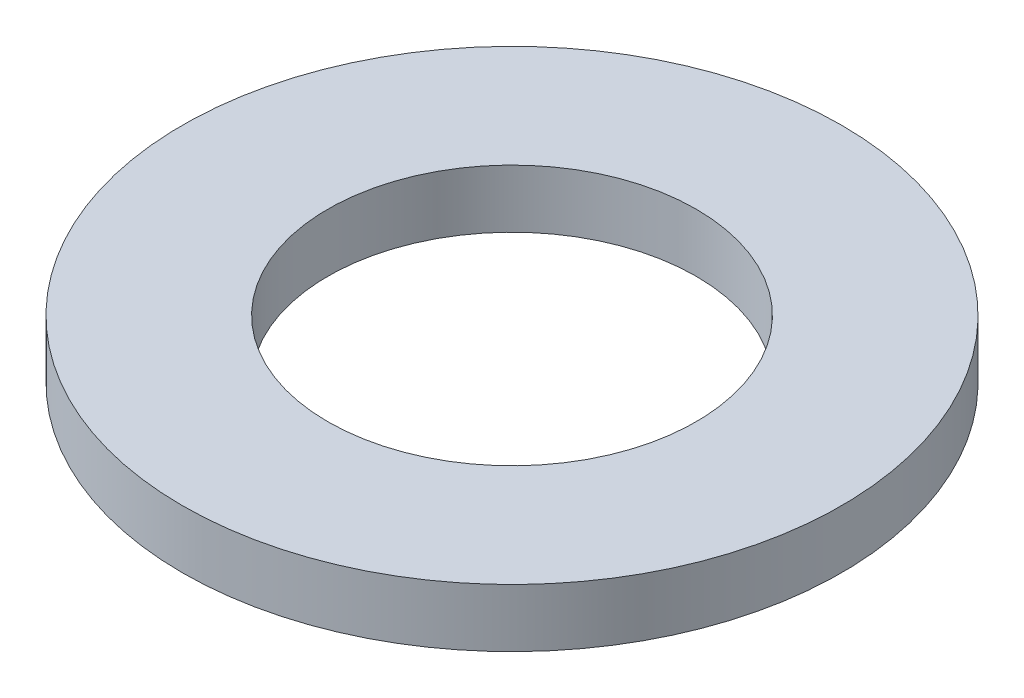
ISO-10303-21;
HEADER;
FILE_DESCRIPTION(('STEP AP214'),'2;1');
FILE_NAME('part.step','',(''),(''),'','','');
FILE_SCHEMA(('AUTOMOTIVE_DESIGN { 1 0 10303 214 1 1 1 1 }'));
ENDSEC;
DATA;
#1=APPLICATION_CONTEXT('core data for automotive mechanical design processes');
#2=APPLICATION_PROTOCOL_DEFINITION('international standard','automotive_design',2000,#1);
#3=PRODUCT_CONTEXT('',#1,'mechanical');
#4=PRODUCT('Part','Part','',(#3));
#5=PRODUCT_RELATED_PRODUCT_CATEGORY('part','',(#4));
#6=PRODUCT_DEFINITION_FORMATION('','',#4);
#7=PRODUCT_DEFINITION_CONTEXT('part definition',#1,'design');
#8=PRODUCT_DEFINITION('design','',#6,#7);
#9=PRODUCT_DEFINITION_SHAPE('','',#8);
#10=(LENGTH_UNIT() NAMED_UNIT(*) SI_UNIT(.MILLI.,.METRE.));
#11=(NAMED_UNIT(*) PLANE_ANGLE_UNIT() SI_UNIT($,.RADIAN.));
#12=(NAMED_UNIT(*) SI_UNIT($,.STERADIAN.) SOLID_ANGLE_UNIT());
#13=UNCERTAINTY_MEASURE_WITH_UNIT(LENGTH_MEASURE(1.E-05),#10,'distance_accuracy_value','');
#14=(GEOMETRIC_REPRESENTATION_CONTEXT(3) GLOBAL_UNCERTAINTY_ASSIGNED_CONTEXT((#13)) GLOBAL_UNIT_ASSIGNED_CONTEXT((#10,
#11,#12)) REPRESENTATION_CONTEXT('',''));
#15=CARTESIAN_POINT('',(0.,0.,0.));
#16=DIRECTION('',(0.,0.,1.));
#17=DIRECTION('',(1.,0.,0.));
#18=AXIS2_PLACEMENT_3D('',#15,#16,#17);
#19=CARTESIAN_POINT('',(0.,3.,0.));
#20=DIRECTION('',(0.,1.,0.));
#21=DIRECTION('',(0.,0.,1.));
#22=AXIS2_PLACEMENT_3D('',#19,#20,#21);
#23=PLANE('',#22);
#24=CARTESIAN_POINT('',(0.,3.,0.));
#25=DIRECTION('',(0.,1.,0.));
#26=DIRECTION('',(0.,0.,1.));
#27=AXIS2_PLACEMENT_3D('',#24,#25,#26);
#28=CIRCLE('',#27,17.);
#29=CARTESIAN_POINT('',(0.,3.,17.));
#30=VERTEX_POINT('',#29);
#31=EDGE_CURVE('E10',#30,#30,#28,.T.);
#32=ORIENTED_EDGE('',*,*,#31,.T.);
#33=EDGE_LOOP('',(#32));
#34=FACE_BOUND('',#33,.T.);
#35=CARTESIAN_POINT('',(0.,3.,0.));
#36=DIRECTION('',(0.,1.,0.));
#37=DIRECTION('',(0.,0.,1.));
#38=AXIS2_PLACEMENT_3D('',#35,#36,#37);
#39=CIRCLE('',#38,9.5);
#40=CARTESIAN_POINT('',(0.,3.,9.5));
#41=VERTEX_POINT('',#40);
#42=EDGE_CURVE('E39',#41,#41,#39,.T.);
#43=ORIENTED_EDGE('',*,*,#42,.F.);
#44=EDGE_LOOP('',(#43));
#45=FACE_BOUND('',#44,.T.);
#46=ADVANCED_FACE('F28',(#34,#45),#23,.T.);
#47=CARTESIAN_POINT('',(0.,0.,0.));
#48=DIRECTION('',(0.,1.,0.));
#49=DIRECTION('',(0.,0.,1.));
#50=AXIS2_PLACEMENT_3D('',#47,#48,#49);
#51=PLANE('',#50);
#52=CARTESIAN_POINT('',(0.,0.,0.));
#53=DIRECTION('',(0.,1.,0.));
#54=DIRECTION('',(0.,0.,1.));
#55=AXIS2_PLACEMENT_3D('',#52,#53,#54);
#56=CIRCLE('',#55,17.);
#57=CARTESIAN_POINT('',(0.,0.,17.));
#58=VERTEX_POINT('',#57);
#59=EDGE_CURVE('E35',#58,#58,#56,.T.);
#60=ORIENTED_EDGE('',*,*,#59,.F.);
#61=EDGE_LOOP('',(#60));
#62=FACE_BOUND('',#61,.T.);
#63=CARTESIAN_POINT('',(0.,0.,0.));
#64=DIRECTION('',(0.,1.,0.));
#65=DIRECTION('',(0.,0.,1.));
#66=AXIS2_PLACEMENT_3D('',#63,#64,#65);
#67=CIRCLE('',#66,9.5);
#68=CARTESIAN_POINT('',(0.,0.,9.5));
#69=VERTEX_POINT('',#68);
#70=EDGE_CURVE('E43',#69,#69,#67,.T.);
#71=ORIENTED_EDGE('',*,*,#70,.T.);
#72=EDGE_LOOP('',(#71));
#73=FACE_BOUND('',#72,.T.);
#74=ADVANCED_FACE('F49',(#62,#73),#51,.F.);
#75=CARTESIAN_POINT('',(0.,3.,0.));
#76=DIRECTION('',(0.,-1.,0.));
#77=DIRECTION('',(0.,0.,-1.));
#78=AXIS2_PLACEMENT_3D('',#75,#76,#77);
#79=CYLINDRICAL_SURFACE('',#78,17.);
#80=ORIENTED_EDGE('',*,*,#31,.F.);
#81=EDGE_LOOP('',(#80));
#82=FACE_BOUND('',#81,.T.);
#83=ORIENTED_EDGE('',*,*,#59,.T.);
#84=EDGE_LOOP('',(#83));
#85=FACE_BOUND('',#84,.T.);
#86=ADVANCED_FACE('F30',(#82,#85),#79,.T.);
#87=CARTESIAN_POINT('',(0.,3.,0.));
#88=DIRECTION('',(0.,-1.,0.));
#89=DIRECTION('',(0.,0.,-1.));
#90=AXIS2_PLACEMENT_3D('',#87,#88,#89);
#91=CYLINDRICAL_SURFACE('',#90,9.5);
#92=ORIENTED_EDGE('',*,*,#42,.T.);
#93=EDGE_LOOP('',(#92));
#94=FACE_BOUND('',#93,.T.);
#95=ORIENTED_EDGE('',*,*,#70,.F.);
#96=EDGE_LOOP('',(#95));
#97=FACE_BOUND('',#96,.T.);
#98=ADVANCED_FACE('F51',(#94,#97),#91,.F.);
#99=CLOSED_SHELL('',(#46,#74,#86,#98));
#100=MANIFOLD_SOLID_BREP('B2',#99);
#101=ADVANCED_BREP_SHAPE_REPRESENTATION('',(#18,#100),#14);
#102=SHAPE_DEFINITION_REPRESENTATION(#9,#101);
ENDSEC;
END-ISO-10303-21;
